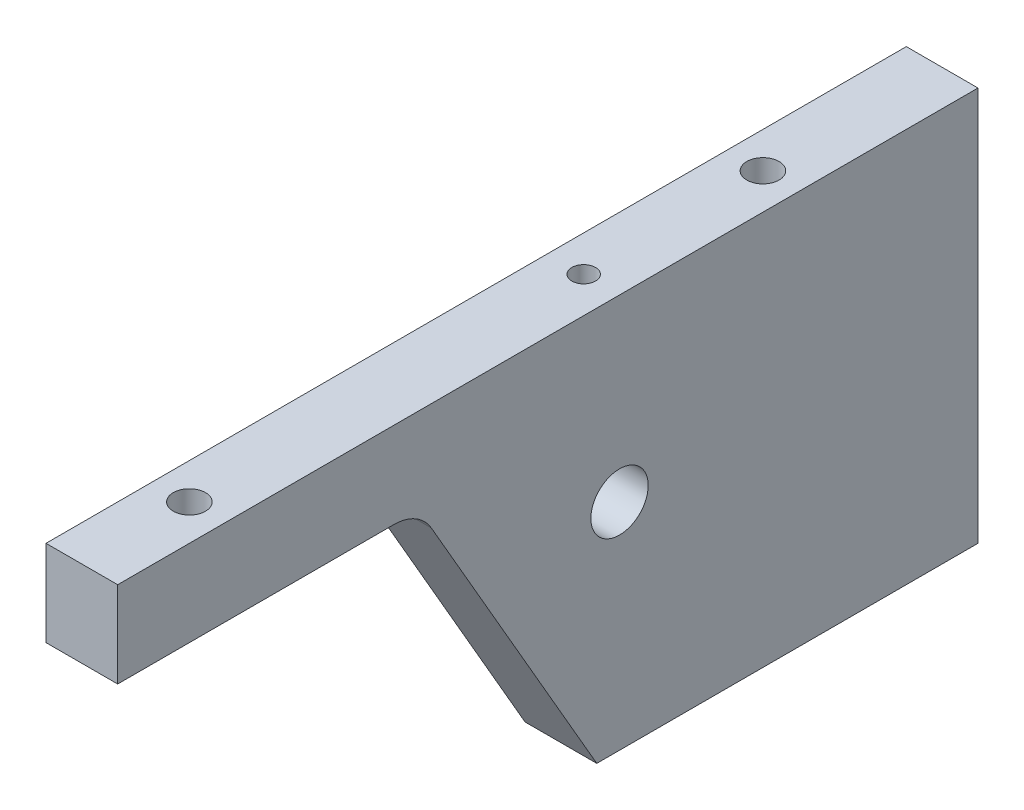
ISO-10303-21;
HEADER;
FILE_DESCRIPTION(('STEP AP214'),'2;1');
FILE_NAME('part.step','',(''),(''),'','','');
FILE_SCHEMA(('AUTOMOTIVE_DESIGN { 1 0 10303 214 1 1 1 1 }'));
ENDSEC;
DATA;
#1=APPLICATION_CONTEXT('core data for automotive mechanical design processes');
#2=APPLICATION_PROTOCOL_DEFINITION('international standard','automotive_design',2000,#1);
#3=PRODUCT_CONTEXT('',#1,'mechanical');
#4=PRODUCT('Part','Part','',(#3));
#5=PRODUCT_RELATED_PRODUCT_CATEGORY('part','',(#4));
#6=PRODUCT_DEFINITION_FORMATION('','',#4);
#7=PRODUCT_DEFINITION_CONTEXT('part definition',#1,'design');
#8=PRODUCT_DEFINITION('design','',#6,#7);
#9=PRODUCT_DEFINITION_SHAPE('','',#8);
#10=(LENGTH_UNIT() NAMED_UNIT(*) SI_UNIT(.MILLI.,.METRE.));
#11=(NAMED_UNIT(*) PLANE_ANGLE_UNIT() SI_UNIT($,.RADIAN.));
#12=(NAMED_UNIT(*) SI_UNIT($,.STERADIAN.) SOLID_ANGLE_UNIT());
#13=UNCERTAINTY_MEASURE_WITH_UNIT(LENGTH_MEASURE(1.E-05),#10,'distance_accuracy_value','');
#14=(GEOMETRIC_REPRESENTATION_CONTEXT(3) GLOBAL_UNCERTAINTY_ASSIGNED_CONTEXT((#13)) GLOBAL_UNIT_ASSIGNED_CONTEXT((#10,
#11,#12)) REPRESENTATION_CONTEXT('',''));
#15=CARTESIAN_POINT('',(0.,0.,0.));
#16=DIRECTION('',(0.,0.,1.));
#17=DIRECTION('',(1.,0.,0.));
#18=AXIS2_PLACEMENT_3D('',#15,#16,#17);
#19=CARTESIAN_POINT('',(5.,0.,120.));
#20=DIRECTION('',(0.,-1.,0.));
#21=DIRECTION('',(0.,0.,-1.));
#22=AXIS2_PLACEMENT_3D('',#19,#20,#21);
#23=PLANE('',#22);
#24=CARTESIAN_POINT('',(0.,0.,105.));
#25=DIRECTION('',(0.,-1.,0.));
#26=DIRECTION('',(0.,0.,-1.));
#27=AXIS2_PLACEMENT_3D('',#24,#25,#26);
#28=CIRCLE('',#27,2.25);
#29=CARTESIAN_POINT('',(0.,0.,102.75));
#30=VERTEX_POINT('',#29);
#31=EDGE_CURVE('E285',#30,#30,#28,.T.);
#32=ORIENTED_EDGE('',*,*,#31,.T.);
#33=EDGE_LOOP('',(#32));
#34=FACE_BOUND('',#33,.T.);
#35=CARTESIAN_POINT('',(0.,0.,25.));
#36=DIRECTION('',(0.,-1.,0.));
#37=DIRECTION('',(0.,0.,-1.));
#38=AXIS2_PLACEMENT_3D('',#35,#36,#37);
#39=CIRCLE('',#38,2.24999999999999);
#40=CARTESIAN_POINT('',(0.,0.,22.75));
#41=VERTEX_POINT('',#40);
#42=EDGE_CURVE('E273',#41,#41,#39,.T.);
#43=ORIENTED_EDGE('',*,*,#42,.T.);
#44=EDGE_LOOP('',(#43));
#45=FACE_BOUND('',#44,.T.);
#46=CARTESIAN_POINT('',(0.,0.,50.));
#47=DIRECTION('',(0.,1.,0.));
#48=DIRECTION('',(0.,0.,1.));
#49=AXIS2_PLACEMENT_3D('',#46,#47,#48);
#50=CIRCLE('',#49,1.65);
#51=CARTESIAN_POINT('',(0.,0.,51.65));
#52=VERTEX_POINT('',#51);
#53=EDGE_CURVE('E264',#52,#52,#50,.T.);
#54=ORIENTED_EDGE('',*,*,#53,.F.);
#55=EDGE_LOOP('',(#54));
#56=FACE_BOUND('',#55,.T.);
#57=DIRECTION('',(0.,0.,1.));
#58=VECTOR('',#57,1.);
#59=CARTESIAN_POINT('',(-5.,0.,120.));
#60=LINE('',#59,#58);
#61=CARTESIAN_POINT('',(-5.,0.,0.));
#62=VERTEX_POINT('',#61);
#63=CARTESIAN_POINT('',(-5.,0.,120.));
#64=VERTEX_POINT('',#63);
#65=EDGE_CURVE('E131',#62,#64,#60,.T.);
#66=ORIENTED_EDGE('',*,*,#65,.T.);
#67=DIRECTION('',(-1.,0.,0.));
#68=VECTOR('',#67,1.);
#69=CARTESIAN_POINT('',(5.,0.,120.));
#70=LINE('',#69,#68);
#71=CARTESIAN_POINT('',(5.,0.,120.));
#72=VERTEX_POINT('',#71);
#73=EDGE_CURVE('E169',#72,#64,#70,.T.);
#74=ORIENTED_EDGE('',*,*,#73,.F.);
#75=DIRECTION('',(0.,0.,1.));
#76=VECTOR('',#75,1.);
#77=CARTESIAN_POINT('',(5.,0.,120.));
#78=LINE('',#77,#76);
#79=CARTESIAN_POINT('',(5.,0.,0.));
#80=VERTEX_POINT('',#79);
#81=EDGE_CURVE('E132',#80,#72,#78,.T.);
#82=ORIENTED_EDGE('',*,*,#81,.F.);
#83=DIRECTION('',(-1.,0.,0.));
#84=VECTOR('',#83,1.);
#85=CARTESIAN_POINT('',(5.,0.,0.));
#86=LINE('',#85,#84);
#87=EDGE_CURVE('E146',#80,#62,#86,.T.);
#88=ORIENTED_EDGE('',*,*,#87,.T.);
#89=EDGE_LOOP('',(#66,#74,#82,#88));
#90=FACE_BOUND('',#89,.T.);
#91=ADVANCED_FACE('F36',(#34,#45,#56,#90),#23,.F.);
#92=CARTESIAN_POINT('',(5.,0.,120.));
#93=DIRECTION('',(0.,0.,-1.));
#94=DIRECTION('',(-1.,0.,0.));
#95=AXIS2_PLACEMENT_3D('',#92,#93,#94);
#96=PLANE('',#95);
#97=DIRECTION('',(0.,-1.,0.));
#98=VECTOR('',#97,1.);
#99=CARTESIAN_POINT('',(-5.,0.,120.));
#100=LINE('',#99,#98);
#101=CARTESIAN_POINT('',(-5.,-12.,120.));
#102=VERTEX_POINT('',#101);
#103=EDGE_CURVE('E149',#64,#102,#100,.T.);
#104=ORIENTED_EDGE('',*,*,#103,.T.);
#105=DIRECTION('',(-1.,0.,0.));
#106=VECTOR('',#105,1.);
#107=CARTESIAN_POINT('',(5.,-12.,120.));
#108=LINE('',#107,#106);
#109=CARTESIAN_POINT('',(5.,-12.,120.));
#110=VERTEX_POINT('',#109);
#111=EDGE_CURVE('E166',#110,#102,#108,.T.);
#112=ORIENTED_EDGE('',*,*,#111,.F.);
#113=DIRECTION('',(0.,-1.,0.));
#114=VECTOR('',#113,1.);
#115=CARTESIAN_POINT('',(5.,0.,120.));
#116=LINE('',#115,#114);
#117=EDGE_CURVE('E135',#72,#110,#116,.T.);
#118=ORIENTED_EDGE('',*,*,#117,.F.);
#119=ORIENTED_EDGE('',*,*,#73,.T.);
#120=EDGE_LOOP('',(#104,#112,#118,#119));
#121=FACE_BOUND('',#120,.T.);
#122=ADVANCED_FACE('F209',(#121),#96,.F.);
#123=CARTESIAN_POINT('',(5.,-12.,120.));
#124=DIRECTION('',(0.,1.,0.));
#125=DIRECTION('',(0.,0.,1.));
#126=AXIS2_PLACEMENT_3D('',#123,#124,#125);
#127=PLANE('',#126);
#128=CARTESIAN_POINT('',(0.,-12.,105.));
#129=DIRECTION('',(0.,-1.,0.));
#130=DIRECTION('',(0.,0.,-1.));
#131=AXIS2_PLACEMENT_3D('',#128,#129,#130);
#132=CIRCLE('',#131,4.);
#133=CARTESIAN_POINT('',(0.,-12.,101.));
#134=VERTEX_POINT('',#133);
#135=EDGE_CURVE('E293',#134,#134,#132,.T.);
#136=ORIENTED_EDGE('',*,*,#135,.F.);
#137=EDGE_LOOP('',(#136));
#138=FACE_BOUND('',#137,.T.);
#139=DIRECTION('',(0.,0.,-1.));
#140=VECTOR('',#139,1.);
#141=CARTESIAN_POINT('',(-5.,-12.,120.));
#142=LINE('',#141,#140);
#143=CARTESIAN_POINT('',(-5.,-12.,81.4641016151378));
#144=VERTEX_POINT('',#143);
#145=EDGE_CURVE('E151',#102,#144,#142,.T.);
#146=ORIENTED_EDGE('',*,*,#145,.T.);
#147=DIRECTION('',(-1.,0.,0.));
#148=VECTOR('',#147,1.);
#149=CARTESIAN_POINT('',(5.,-12.,81.4641016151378));
#150=LINE('',#149,#148);
#151=CARTESIAN_POINT('',(5.,-12.,81.4641016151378));
#152=VERTEX_POINT('',#151);
#153=EDGE_CURVE('E51',#144,#152,#150,.F.);
#154=ORIENTED_EDGE('',*,*,#153,.T.);
#155=DIRECTION('',(0.,0.,-1.));
#156=VECTOR('',#155,1.);
#157=CARTESIAN_POINT('',(5.,-12.,120.));
#158=LINE('',#157,#156);
#159=EDGE_CURVE('E138',#110,#152,#158,.T.);
#160=ORIENTED_EDGE('',*,*,#159,.F.);
#161=ORIENTED_EDGE('',*,*,#111,.T.);
#162=EDGE_LOOP('',(#146,#154,#160,#161));
#163=FACE_BOUND('',#162,.T.);
#164=ADVANCED_FACE('F214',(#138,#163),#127,.F.);
#165=CARTESIAN_POINT('',(5.,-12.,78.));
#166=DIRECTION('',(0.,0.499999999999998,-0.86602540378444));
#167=DIRECTION('',(0.,0.86602540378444,0.499999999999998));
#168=AXIS2_PLACEMENT_3D('',#165,#166,#167);
#169=PLANE('',#168);
#170=DIRECTION('',(0.,-0.86602540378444,-0.499999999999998));
#171=VECTOR('',#170,1.);
#172=CARTESIAN_POINT('',(5.,-12.,78.));
#173=LINE('',#172,#171);
#174=CARTESIAN_POINT('',(5.,-15.,76.2679491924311));
#175=VERTEX_POINT('',#174);
#176=CARTESIAN_POINT('',(5.,-55.,53.1739384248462));
#177=VERTEX_POINT('',#176);
#178=EDGE_CURVE('E140',#175,#177,#173,.T.);
#179=ORIENTED_EDGE('',*,*,#178,.F.);
#180=DIRECTION('',(-1.,0.,0.));
#181=VECTOR('',#180,1.);
#182=CARTESIAN_POINT('',(-5.,-15.,76.2679491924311));
#183=LINE('',#182,#181);
#184=CARTESIAN_POINT('',(-5.,-15.,76.2679491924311));
#185=VERTEX_POINT('',#184);
#186=EDGE_CURVE('E172',#175,#185,#183,.T.);
#187=ORIENTED_EDGE('',*,*,#186,.T.);
#188=DIRECTION('',(0.,-0.86602540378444,-0.499999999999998));
#189=VECTOR('',#188,1.);
#190=CARTESIAN_POINT('',(-5.,-12.,78.));
#191=LINE('',#190,#189);
#192=CARTESIAN_POINT('',(-5.,-55.,53.1739384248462));
#193=VERTEX_POINT('',#192);
#194=EDGE_CURVE('E153',#185,#193,#191,.T.);
#195=ORIENTED_EDGE('',*,*,#194,.T.);
#196=DIRECTION('',(-1.,0.,0.));
#197=VECTOR('',#196,1.);
#198=CARTESIAN_POINT('',(5.,-55.,53.1739384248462));
#199=LINE('',#198,#197);
#200=EDGE_CURVE('E163',#177,#193,#199,.T.);
#201=ORIENTED_EDGE('',*,*,#200,.F.);
#202=EDGE_LOOP('',(#179,#187,#195,#201));
#203=FACE_BOUND('',#202,.T.);
#204=ADVANCED_FACE('F178',(#203),#169,.F.);
#205=CARTESIAN_POINT('',(5.,-55.,0.));
#206=DIRECTION('',(0.,1.,0.));
#207=DIRECTION('',(0.,0.,1.));
#208=AXIS2_PLACEMENT_3D('',#205,#206,#207);
#209=PLANE('',#208);
#210=CARTESIAN_POINT('',(0.,-55.,25.));
#211=DIRECTION('',(0.,-1.,0.));
#212=DIRECTION('',(0.,0.,-1.));
#213=AXIS2_PLACEMENT_3D('',#210,#211,#212);
#214=CIRCLE('',#213,4.);
#215=CARTESIAN_POINT('',(0.,-55.,21.));
#216=VERTEX_POINT('',#215);
#217=EDGE_CURVE('E282',#216,#216,#214,.T.);
#218=ORIENTED_EDGE('',*,*,#217,.F.);
#219=EDGE_LOOP('',(#218));
#220=FACE_BOUND('',#219,.T.);
#221=DIRECTION('',(0.,0.,-1.));
#222=VECTOR('',#221,1.);
#223=CARTESIAN_POINT('',(-5.,-55.,0.));
#224=LINE('',#223,#222);
#225=CARTESIAN_POINT('',(-5.,-55.,0.));
#226=VERTEX_POINT('',#225);
#227=EDGE_CURVE('E155',#193,#226,#224,.T.);
#228=ORIENTED_EDGE('',*,*,#227,.T.);
#229=DIRECTION('',(-1.,0.,0.));
#230=VECTOR('',#229,1.);
#231=CARTESIAN_POINT('',(5.,-55.,0.));
#232=LINE('',#231,#230);
#233=CARTESIAN_POINT('',(5.,-55.,0.));
#234=VERTEX_POINT('',#233);
#235=EDGE_CURVE('E160',#234,#226,#232,.T.);
#236=ORIENTED_EDGE('',*,*,#235,.F.);
#237=DIRECTION('',(0.,0.,-1.));
#238=VECTOR('',#237,1.);
#239=CARTESIAN_POINT('',(5.,-55.,0.));
#240=LINE('',#239,#238);
#241=EDGE_CURVE('E142',#177,#234,#240,.T.);
#242=ORIENTED_EDGE('',*,*,#241,.F.);
#243=ORIENTED_EDGE('',*,*,#200,.T.);
#244=EDGE_LOOP('',(#228,#236,#242,#243));
#245=FACE_BOUND('',#244,.T.);
#246=ADVANCED_FACE('F188',(#220,#245),#209,.F.);
#247=CARTESIAN_POINT('',(5.,0.,0.));
#248=DIRECTION('',(0.,0.,1.));
#249=DIRECTION('',(0.,-1.,0.));
#250=AXIS2_PLACEMENT_3D('',#247,#248,#249);
#251=PLANE('',#250);
#252=CARTESIAN_POINT('',(0.,-10.,0.));
#253=DIRECTION('',(0.,0.,-1.));
#254=DIRECTION('',(0.,1.,0.));
#255=AXIS2_PLACEMENT_3D('',#252,#253,#254);
#256=CIRCLE('',#255,1.65);
#257=CARTESIAN_POINT('',(0.,-8.35,0.));
#258=VERTEX_POINT('',#257);
#259=EDGE_CURVE('E113',#258,#258,#256,.T.);
#260=ORIENTED_EDGE('',*,*,#259,.F.);
#261=EDGE_LOOP('',(#260));
#262=FACE_BOUND('',#261,.T.);
#263=CARTESIAN_POINT('',(0.,-27.5,0.));
#264=DIRECTION('',(0.,0.,-1.));
#265=DIRECTION('',(0.,1.,0.));
#266=AXIS2_PLACEMENT_3D('',#263,#264,#265);
#267=CIRCLE('',#266,1.65);
#268=CARTESIAN_POINT('',(0.,-25.85,0.));
#269=VERTEX_POINT('',#268);
#270=EDGE_CURVE('E112',#269,#269,#267,.T.);
#271=ORIENTED_EDGE('',*,*,#270,.F.);
#272=EDGE_LOOP('',(#271));
#273=FACE_BOUND('',#272,.T.);
#274=CARTESIAN_POINT('',(0.,-45.,0.));
#275=DIRECTION('',(0.,0.,-1.));
#276=DIRECTION('',(0.,1.,0.));
#277=AXIS2_PLACEMENT_3D('',#274,#275,#276);
#278=CIRCLE('',#277,1.65);
#279=CARTESIAN_POINT('',(0.,-43.35,0.));
#280=VERTEX_POINT('',#279);
#281=EDGE_CURVE('E125',#280,#280,#278,.T.);
#282=ORIENTED_EDGE('',*,*,#281,.F.);
#283=EDGE_LOOP('',(#282));
#284=FACE_BOUND('',#283,.T.);
#285=DIRECTION('',(0.,1.,0.));
#286=VECTOR('',#285,1.);
#287=CARTESIAN_POINT('',(-5.,0.,0.));
#288=LINE('',#287,#286);
#289=EDGE_CURVE('E136',#226,#62,#288,.T.);
#290=ORIENTED_EDGE('',*,*,#289,.T.);
#291=ORIENTED_EDGE('',*,*,#87,.F.);
#292=DIRECTION('',(0.,1.,0.));
#293=VECTOR('',#292,1.);
#294=CARTESIAN_POINT('',(5.,0.,0.));
#295=LINE('',#294,#293);
#296=EDGE_CURVE('E144',#234,#80,#295,.T.);
#297=ORIENTED_EDGE('',*,*,#296,.F.);
#298=ORIENTED_EDGE('',*,*,#235,.T.);
#299=EDGE_LOOP('',(#290,#291,#297,#298));
#300=FACE_BOUND('',#299,.T.);
#301=ADVANCED_FACE('F192',(#262,#273,#284,#300),#251,.F.);
#302=CARTESIAN_POINT('',(5.,0.,0.));
#303=DIRECTION('',(-1.,0.,0.));
#304=DIRECTION('',(0.,0.,1.));
#305=AXIS2_PLACEMENT_3D('',#302,#303,#304);
#306=PLANE('',#305);
#307=CARTESIAN_POINT('',(5.,-25.,50.));
#308=DIRECTION('',(1.,0.,0.));
#309=DIRECTION('',(0.,0.,-1.));
#310=AXIS2_PLACEMENT_3D('',#307,#308,#309);
#311=CIRCLE('',#310,4.00000000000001);
#312=CARTESIAN_POINT('',(5.,-25.,46.));
#313=VERTEX_POINT('',#312);
#314=EDGE_CURVE('E263',#313,#313,#311,.T.);
#315=ORIENTED_EDGE('',*,*,#314,.F.);
#316=EDGE_LOOP('',(#315));
#317=FACE_BOUND('',#316,.T.);
#318=ORIENTED_EDGE('',*,*,#81,.T.);
#319=ORIENTED_EDGE('',*,*,#117,.T.);
#320=ORIENTED_EDGE('',*,*,#159,.T.);
#321=CARTESIAN_POINT('',(5.,-18.,81.4641016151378));
#322=DIRECTION('',(-1.,0.,0.));
#323=DIRECTION('',(0.,0.,1.));
#324=AXIS2_PLACEMENT_3D('',#321,#322,#323);
#325=CIRCLE('',#324,6.);
#326=EDGE_CURVE('E11',#152,#175,#325,.T.);
#327=ORIENTED_EDGE('',*,*,#326,.T.);
#328=ORIENTED_EDGE('',*,*,#178,.T.);
#329=ORIENTED_EDGE('',*,*,#241,.T.);
#330=ORIENTED_EDGE('',*,*,#296,.T.);
#331=EDGE_LOOP('',(#318,#319,#320,#327,#328,#329,#330));
#332=FACE_BOUND('',#331,.T.);
#333=ADVANCED_FACE('F196',(#317,#332),#306,.F.);
#334=CARTESIAN_POINT('',(-5.,0.,0.));
#335=DIRECTION('',(-1.,0.,0.));
#336=DIRECTION('',(0.,0.,1.));
#337=AXIS2_PLACEMENT_3D('',#334,#335,#336);
#338=PLANE('',#337);
#339=CARTESIAN_POINT('',(-5.,-25.,50.));
#340=DIRECTION('',(-1.,0.,0.));
#341=DIRECTION('',(0.,0.,1.));
#342=AXIS2_PLACEMENT_3D('',#339,#340,#341);
#343=CIRCLE('',#342,4.00000000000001);
#344=CARTESIAN_POINT('',(-5.,-25.,54.));
#345=VERTEX_POINT('',#344);
#346=EDGE_CURVE('E119',#345,#345,#343,.F.);
#347=ORIENTED_EDGE('',*,*,#346,.T.);
#348=EDGE_LOOP('',(#347));
#349=FACE_BOUND('',#348,.T.);
#350=ORIENTED_EDGE('',*,*,#65,.F.);
#351=ORIENTED_EDGE('',*,*,#289,.F.);
#352=ORIENTED_EDGE('',*,*,#227,.F.);
#353=ORIENTED_EDGE('',*,*,#194,.F.);
#354=CARTESIAN_POINT('',(-5.,-18.,81.4641016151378));
#355=DIRECTION('',(-1.,0.,0.));
#356=DIRECTION('',(0.,0.,1.));
#357=AXIS2_PLACEMENT_3D('',#354,#355,#356);
#358=CIRCLE('',#357,6.);
#359=EDGE_CURVE('E44',#185,#144,#358,.F.);
#360=ORIENTED_EDGE('',*,*,#359,.T.);
#361=ORIENTED_EDGE('',*,*,#145,.F.);
#362=ORIENTED_EDGE('',*,*,#103,.F.);
#363=EDGE_LOOP('',(#350,#351,#352,#353,#360,#361,#362));
#364=FACE_BOUND('',#363,.T.);
#365=ADVANCED_FACE('F184',(#349,#364),#338,.T.);
#366=CARTESIAN_POINT('',(0.,-45.,10.1));
#367=DIRECTION('',(0.,0.,-1.));
#368=DIRECTION('',(0.,1.,0.));
#369=AXIS2_PLACEMENT_3D('',#366,#367,#368);
#370=CONICAL_SURFACE('',#369,1.65,1.02974425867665);
#371=CARTESIAN_POINT('',(0.,-45.,11.0914200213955));
#372=VERTEX_POINT('',#371);
#373=VERTEX_LOOP('',#372);
#374=FACE_BOUND('',#373,.T.);
#375=CARTESIAN_POINT('',(0.,-45.,10.1));
#376=DIRECTION('',(0.,0.,-1.));
#377=DIRECTION('',(0.,1.,0.));
#378=AXIS2_PLACEMENT_3D('',#375,#376,#377);
#379=CIRCLE('',#378,1.65);
#380=CARTESIAN_POINT('',(0.,-43.35,10.1));
#381=VERTEX_POINT('',#380);
#382=EDGE_CURVE('E128',#381,#381,#379,.T.);
#383=ORIENTED_EDGE('',*,*,#382,.T.);
#384=EDGE_LOOP('',(#383));
#385=FACE_BOUND('',#384,.T.);
#386=ADVANCED_FACE('F233',(#374,#385),#370,.F.);
#387=CARTESIAN_POINT('',(0.,-45.,0.));
#388=DIRECTION('',(0.,0.,-1.));
#389=DIRECTION('',(0.,1.,0.));
#390=AXIS2_PLACEMENT_3D('',#387,#388,#389);
#391=CYLINDRICAL_SURFACE('',#390,1.65);
#392=ORIENTED_EDGE('',*,*,#382,.F.);
#393=EDGE_LOOP('',(#392));
#394=FACE_BOUND('',#393,.T.);
#395=ORIENTED_EDGE('',*,*,#281,.T.);
#396=EDGE_LOOP('',(#395));
#397=FACE_BOUND('',#396,.T.);
#398=ADVANCED_FACE('F240',(#394,#397),#391,.F.);
#399=CARTESIAN_POINT('',(0.,-27.5,10.1));
#400=DIRECTION('',(0.,0.,-1.));
#401=DIRECTION('',(0.,1.,0.));
#402=AXIS2_PLACEMENT_3D('',#399,#400,#401);
#403=CONICAL_SURFACE('',#402,1.65,1.02974425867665);
#404=CARTESIAN_POINT('',(0.,-27.5,11.0914200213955));
#405=VERTEX_POINT('',#404);
#406=VERTEX_LOOP('',#405);
#407=FACE_BOUND('',#406,.T.);
#408=CARTESIAN_POINT('',(0.,-27.5,10.1));
#409=DIRECTION('',(0.,0.,-1.));
#410=DIRECTION('',(0.,1.,0.));
#411=AXIS2_PLACEMENT_3D('',#408,#409,#410);
#412=CIRCLE('',#411,1.65);
#413=CARTESIAN_POINT('',(0.,-25.85,10.1));
#414=VERTEX_POINT('',#413);
#415=EDGE_CURVE('E116',#414,#414,#412,.T.);
#416=ORIENTED_EDGE('',*,*,#415,.T.);
#417=EDGE_LOOP('',(#416));
#418=FACE_BOUND('',#417,.T.);
#419=ADVANCED_FACE('F244',(#407,#418),#403,.F.);
#420=CARTESIAN_POINT('',(0.,-27.5,0.));
#421=DIRECTION('',(0.,0.,-1.));
#422=DIRECTION('',(0.,1.,0.));
#423=AXIS2_PLACEMENT_3D('',#420,#421,#422);
#424=CYLINDRICAL_SURFACE('',#423,1.65);
#425=ORIENTED_EDGE('',*,*,#415,.F.);
#426=EDGE_LOOP('',(#425));
#427=FACE_BOUND('',#426,.T.);
#428=ORIENTED_EDGE('',*,*,#270,.T.);
#429=EDGE_LOOP('',(#428));
#430=FACE_BOUND('',#429,.T.);
#431=ADVANCED_FACE('F106',(#427,#430),#424,.F.);
#432=CARTESIAN_POINT('',(0.,-10.,10.1));
#433=DIRECTION('',(0.,0.,-1.));
#434=DIRECTION('',(0.,1.,0.));
#435=AXIS2_PLACEMENT_3D('',#432,#433,#434);
#436=CONICAL_SURFACE('',#435,1.65,1.02974425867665);
#437=CARTESIAN_POINT('',(0.,-10.,11.0914200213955));
#438=VERTEX_POINT('',#437);
#439=VERTEX_LOOP('',#438);
#440=FACE_BOUND('',#439,.T.);
#441=CARTESIAN_POINT('',(0.,-10.,10.1));
#442=DIRECTION('',(0.,0.,-1.));
#443=DIRECTION('',(0.,1.,0.));
#444=AXIS2_PLACEMENT_3D('',#441,#442,#443);
#445=CIRCLE('',#444,1.65);
#446=CARTESIAN_POINT('',(0.,-8.35000000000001,10.1));
#447=VERTEX_POINT('',#446);
#448=EDGE_CURVE('E110',#447,#447,#445,.T.);
#449=ORIENTED_EDGE('',*,*,#448,.T.);
#450=EDGE_LOOP('',(#449));
#451=FACE_BOUND('',#450,.T.);
#452=ADVANCED_FACE('F102',(#440,#451),#436,.F.);
#453=CARTESIAN_POINT('',(0.,-10.,0.));
#454=DIRECTION('',(0.,0.,-1.));
#455=DIRECTION('',(0.,1.,0.));
#456=AXIS2_PLACEMENT_3D('',#453,#454,#455);
#457=CYLINDRICAL_SURFACE('',#456,1.65);
#458=ORIENTED_EDGE('',*,*,#448,.F.);
#459=EDGE_LOOP('',(#458));
#460=FACE_BOUND('',#459,.T.);
#461=ORIENTED_EDGE('',*,*,#259,.T.);
#462=EDGE_LOOP('',(#461));
#463=FACE_BOUND('',#462,.T.);
#464=ADVANCED_FACE('F105',(#460,#463),#457,.F.);
#465=CARTESIAN_POINT('',(5.,-18.,81.4641016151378));
#466=DIRECTION('',(1.,0.,0.));
#467=DIRECTION('',(0.,0.,-1.));
#468=AXIS2_PLACEMENT_3D('',#465,#466,#467);
#469=CYLINDRICAL_SURFACE('',#468,6.);
#470=ORIENTED_EDGE('',*,*,#326,.F.);
#471=ORIENTED_EDGE('',*,*,#153,.F.);
#472=ORIENTED_EDGE('',*,*,#359,.F.);
#473=ORIENTED_EDGE('',*,*,#186,.F.);
#474=EDGE_LOOP('',(#470,#471,#472,#473));
#475=FACE_BOUND('',#474,.T.);
#476=ADVANCED_FACE('F38',(#475),#469,.F.);
#477=CARTESIAN_POINT('',(-16.3137084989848,-25.,50.));
#478=DIRECTION('',(1.,0.,0.));
#479=DIRECTION('',(0.,0.,-1.));
#480=AXIS2_PLACEMENT_3D('',#477,#478,#479);
#481=CYLINDRICAL_SURFACE('',#480,4.00000000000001);
#482=CARTESIAN_POINT('',(0.,-21.3561695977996,51.65));
#483=CARTESIAN_POINT('',(0.0880964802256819,-21.3561605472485,51.649990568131));
#484=CARTESIAN_POINT('',(0.176340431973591,-21.3529282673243,51.6428998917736));
#485=CARTESIAN_POINT('',(0.350287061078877,-21.3404079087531,51.6148084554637));
#486=CARTESIAN_POINT('',(0.435982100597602,-21.3311032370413,51.5937695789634));
#487=CARTESIAN_POINT('',(0.602002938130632,-21.3076867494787,51.5387353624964));
#488=CARTESIAN_POINT('',(0.682348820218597,-21.2935942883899,51.5047921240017));
#489=CARTESIAN_POINT('',(0.836181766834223,-21.2622176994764,51.4250653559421));
#490=CARTESIAN_POINT('',(0.909670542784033,-21.2449343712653,51.3792847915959));
#491=CARTESIAN_POINT('',(1.0522286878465,-21.2079446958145,51.2741985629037));
#492=CARTESIAN_POINT('',(1.12082925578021,-21.1881572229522,51.2142851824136));
#493=CARTESIAN_POINT('',(1.24735477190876,-21.1490563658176,51.0839107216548));
#494=CARTESIAN_POINT('',(1.30527565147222,-21.129743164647,51.0134456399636));
#495=CARTESIAN_POINT('',(1.41117137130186,-21.0927842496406,50.8603019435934));
#496=CARTESIAN_POINT('',(1.45862093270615,-21.0752438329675,50.7772323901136));
#497=CARTESIAN_POINT('',(1.5386701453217,-21.044797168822,50.6034363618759));
#498=CARTESIAN_POINT('',(1.57127626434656,-21.0318889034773,50.512713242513));
#499=CARTESIAN_POINT('',(1.61902070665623,-21.0127359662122,50.3311051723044));
#500=CARTESIAN_POINT('',(1.63496684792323,-21.0061843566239,50.2404656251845));
#501=CARTESIAN_POINT('',(1.65154665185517,-20.9993693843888,50.0575763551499));
#502=CARTESIAN_POINT('',(1.65218639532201,-20.9991035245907,49.965327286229));
#503=CARTESIAN_POINT('',(1.6385635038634,-21.0047077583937,49.787702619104));
#504=CARTESIAN_POINT('',(1.6251878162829,-21.0102126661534,49.7022453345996));
#505=CARTESIAN_POINT('',(1.58543118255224,-21.0262407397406,49.5349141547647));
#506=CARTESIAN_POINT('',(1.55904927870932,-21.036764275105,49.4530405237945));
#507=CARTESIAN_POINT('',(1.49371233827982,-21.062010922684,49.2937043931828));
#508=CARTESIAN_POINT('',(1.45457201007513,-21.0767955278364,49.2163280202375));
#509=CARTESIAN_POINT('',(1.3650087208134,-21.1091123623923,49.0690395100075));
#510=CARTESIAN_POINT('',(1.3145817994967,-21.1266455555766,48.9991300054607));
#511=CARTESIAN_POINT('',(1.19981176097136,-21.1641286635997,48.8636146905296));
#512=CARTESIAN_POINT('',(1.13474658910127,-21.1841618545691,48.7986425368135));
#513=CARTESIAN_POINT('',(0.994590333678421,-21.2234685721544,48.6802616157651));
#514=CARTESIAN_POINT('',(0.919495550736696,-21.2427418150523,48.626857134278));
#515=CARTESIAN_POINT('',(0.758401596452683,-21.2789339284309,48.5315466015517));
#516=CARTESIAN_POINT('',(0.672132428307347,-21.2957589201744,48.4900582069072));
#517=CARTESIAN_POINT('',(0.492953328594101,-21.3240361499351,48.422454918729));
#518=CARTESIAN_POINT('',(0.400048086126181,-21.3354921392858,48.3963292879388));
#519=CARTESIAN_POINT('',(0.216577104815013,-21.3508090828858,48.3617867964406));
#520=CARTESIAN_POINT('',(0.126241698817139,-21.3551088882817,48.3523443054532));
#521=CARTESIAN_POINT('',(-0.0548056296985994,-21.3568801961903,48.3484289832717));
#522=CARTESIAN_POINT('',(-0.145517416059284,-21.3543539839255,48.353951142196));
#523=CARTESIAN_POINT('',(-0.318801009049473,-21.3432105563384,48.3788728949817));
#524=CARTESIAN_POINT('',(-0.401528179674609,-21.3349819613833,48.3973879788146));
#525=CARTESIAN_POINT('',(-0.562637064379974,-21.3138538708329,48.4466041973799));
#526=CARTESIAN_POINT('',(-0.64101777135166,-21.3009532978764,48.4773081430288));
#527=CARTESIAN_POINT('',(-0.794879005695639,-21.2712752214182,48.5514609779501));
#528=CARTESIAN_POINT('',(-0.870100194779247,-21.2543578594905,48.5953902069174));
#529=CARTESIAN_POINT('',(-1.01246016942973,-21.2187547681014,48.6942654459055));
#530=CARTESIAN_POINT('',(-1.07959548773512,-21.2000682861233,48.7492161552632));
#531=CARTESIAN_POINT('',(-1.20942962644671,-21.1612398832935,48.873724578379));
#532=CARTESIAN_POINT('',(-1.27135173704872,-21.1411003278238,48.944096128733));
#533=CARTESIAN_POINT('',(-1.38264285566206,-21.1030188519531,49.0947020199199));
#534=CARTESIAN_POINT('',(-1.43201105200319,-21.0850770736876,49.1749369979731));
#535=CARTESIAN_POINT('',(-1.51670413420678,-21.0533123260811,49.3434831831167));
#536=CARTESIAN_POINT('',(-1.55200347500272,-21.0394968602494,49.4318087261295));
#537=CARTESIAN_POINT('',(-1.60699165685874,-21.0176289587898,49.6138591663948));
#538=CARTESIAN_POINT('',(-1.62668958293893,-21.0095731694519,49.7075808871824));
#539=CARTESIAN_POINT('',(-1.64878822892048,-21.0005110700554,49.8908128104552));
#540=CARTESIAN_POINT('',(-1.65228482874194,-20.9990582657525,49.9801696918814));
#541=CARTESIAN_POINT('',(-1.64481456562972,-21.0021377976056,50.1581617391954));
#542=CARTESIAN_POINT('',(-1.63385015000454,-21.0066691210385,50.2467970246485));
#543=CARTESIAN_POINT('',(-1.59855535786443,-21.020975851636,50.4177053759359));
#544=CARTESIAN_POINT('',(-1.57469555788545,-21.0305663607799,50.5000923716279));
#545=CARTESIAN_POINT('',(-1.51479588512,-21.0539451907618,50.6596673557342));
#546=CARTESIAN_POINT('',(-1.47875367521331,-21.0677343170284,50.7368543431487));
#547=CARTESIAN_POINT('',(-1.39369547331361,-21.0989419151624,50.8876611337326));
#548=CARTESIAN_POINT('',(-1.34416874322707,-21.1164957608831,50.9609642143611));
#549=CARTESIAN_POINT('',(-1.23429715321,-21.1531429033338,51.098529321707));
#550=CARTESIAN_POINT('',(-1.17394837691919,-21.1722367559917,51.1627880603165));
#551=CARTESIAN_POINT('',(-1.03941247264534,-21.2114025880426,51.2848776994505));
#552=CARTESIAN_POINT('',(-0.964572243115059,-21.2314552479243,51.3419976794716));
#553=CARTESIAN_POINT('',(-0.805734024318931,-21.2689458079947,51.4429647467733));
#554=CARTESIAN_POINT('',(-0.721731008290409,-21.2863822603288,51.486804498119));
#555=CARTESIAN_POINT('',(-0.547271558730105,-21.3162961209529,51.5594444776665));
#556=CARTESIAN_POINT('',(-0.456860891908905,-21.3288051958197,51.5883411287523));
#557=CARTESIAN_POINT('',(-0.271952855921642,-21.3471816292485,51.6301726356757));
#558=CARTESIAN_POINT('',(-0.177470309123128,-21.3530712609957,51.6431610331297));
#559=CARTESIAN_POINT('',(-0.0551366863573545,-21.3558594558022,51.6493120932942));
#560=CARTESIAN_POINT('',(-0.0275755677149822,-21.3561724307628,51.6500029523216));
#561=CARTESIAN_POINT('',(0.,-21.3561695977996,51.65));
#562=B_SPLINE_CURVE_WITH_KNOTS('',3,(#482,#483,#484,#485,#486,#487,#488,#489,#490,#491,#492,
#493,#494,#495,#496,#497,#498,#499,#500,#501,#502,#503,#504,#505,#506,#507,#508,#509,#510,#511,
#512,#513,#514,#515,#516,#517,#518,#519,#520,#521,#522,#523,#524,#525,#526,#527,#528,#529,#530,
#531,#532,#533,#534,#535,#536,#537,#538,#539,#540,#541,#542,#543,#544,#545,#546,#547,#548,#549,
#550,#551,#552,#553,#554,#555,#556,#557,#558,#559,#560,#561),.UNSPECIFIED.,.T.,.F.,(4,2,2,2,2,2,
2,2,2,2,2,2,2,2,2,2,2,2,2,2,2,2,2,2,2,2,2,2,2,2,2,2,2,2,2,2,2,2,2,4),(0.,0.264211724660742,
0.529148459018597,0.79302667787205,1.05683885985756,1.33523297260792,1.61373292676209,
1.90403076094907,2.19420198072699,2.46953816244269,2.74476495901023,3.00356896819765,
3.2623920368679,3.52515526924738,3.78801084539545,4.06907613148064,4.35024537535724,
4.64031806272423,4.9301877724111,5.20152035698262,5.47276211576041,5.72713321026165,
5.98156300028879,6.24665916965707,6.51186861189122,6.79815687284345,7.08446363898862,
7.37128791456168,7.65794504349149,7.92489841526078,8.19180661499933,8.44957452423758,
8.70739191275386,8.97680852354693,9.24632283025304,9.53374725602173,9.82133016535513,
10.1070334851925,10.3917725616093,10.4744749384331),.UNSPECIFIED.);
#563=CARTESIAN_POINT('',(0.,-21.3561695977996,51.65));
#564=VERTEX_POINT('',#563);
#565=EDGE_CURVE('E257',#564,#564,#562,.T.);
#566=ORIENTED_EDGE('',*,*,#565,.T.);
#567=EDGE_LOOP('',(#566));
#568=FACE_BOUND('',#567,.T.);
#569=ORIENTED_EDGE('',*,*,#314,.T.);
#570=EDGE_LOOP('',(#569));
#571=FACE_BOUND('',#570,.T.);
#572=ORIENTED_EDGE('',*,*,#346,.F.);
#573=EDGE_LOOP('',(#572));
#574=FACE_BOUND('',#573,.T.);
#575=ADVANCED_FACE('F199',(#568,#571,#574),#481,.F.);
#576=CARTESIAN_POINT('',(0.,0.,50.));
#577=DIRECTION('',(0.,1.,0.));
#578=DIRECTION('',(0.,0.,1.));
#579=AXIS2_PLACEMENT_3D('',#576,#577,#578);
#580=CYLINDRICAL_SURFACE('',#579,1.65);
#581=ORIENTED_EDGE('',*,*,#565,.F.);
#582=EDGE_LOOP('',(#581));
#583=FACE_BOUND('',#582,.T.);
#584=ORIENTED_EDGE('',*,*,#53,.T.);
#585=EDGE_LOOP('',(#584));
#586=FACE_BOUND('',#585,.T.);
#587=ADVANCED_FACE('F204',(#583,#586),#580,.F.);
#588=CARTESIAN_POINT('',(0.,-55.,25.));
#589=DIRECTION('',(0.,-1.,0.));
#590=DIRECTION('',(0.,0.,-1.));
#591=AXIS2_PLACEMENT_3D('',#588,#589,#590);
#592=CYLINDRICAL_SURFACE('',#591,2.24999999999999);
#593=ORIENTED_EDGE('',*,*,#42,.F.);
#594=EDGE_LOOP('',(#593));
#595=FACE_BOUND('',#594,.T.);
#596=CARTESIAN_POINT('',(0.,-25.,25.));
#597=DIRECTION('',(0.,-1.,0.));
#598=DIRECTION('',(0.,0.,-1.));
#599=AXIS2_PLACEMENT_3D('',#596,#597,#598);
#600=CIRCLE('',#599,2.25);
#601=CARTESIAN_POINT('',(0.,-25.,22.75));
#602=VERTEX_POINT('',#601);
#603=EDGE_CURVE('E276',#602,#602,#600,.T.);
#604=ORIENTED_EDGE('',*,*,#603,.T.);
#605=EDGE_LOOP('',(#604));
#606=FACE_BOUND('',#605,.T.);
#607=ADVANCED_FACE('F321',(#595,#606),#592,.F.);
#608=CARTESIAN_POINT('',(2.25,-25.,25.));
#609=DIRECTION('',(0.,1.,0.));
#610=DIRECTION('',(0.,0.,1.));
#611=AXIS2_PLACEMENT_3D('',#608,#609,#610);
#612=PLANE('',#611);
#613=ORIENTED_EDGE('',*,*,#603,.F.);
#614=EDGE_LOOP('',(#613));
#615=FACE_BOUND('',#614,.T.);
#616=CARTESIAN_POINT('',(0.,-25.,25.));
#617=DIRECTION('',(0.,-1.,0.));
#618=DIRECTION('',(0.,0.,-1.));
#619=AXIS2_PLACEMENT_3D('',#616,#617,#618);
#620=CIRCLE('',#619,4.);
#621=CARTESIAN_POINT('',(0.,-25.,21.));
#622=VERTEX_POINT('',#621);
#623=EDGE_CURVE('E279',#622,#622,#620,.T.);
#624=ORIENTED_EDGE('',*,*,#623,.T.);
#625=EDGE_LOOP('',(#624));
#626=FACE_BOUND('',#625,.T.);
#627=ADVANCED_FACE('F318',(#615,#626),#612,.F.);
#628=CARTESIAN_POINT('',(0.,-55.,25.));
#629=DIRECTION('',(0.,-1.,0.));
#630=DIRECTION('',(0.,0.,-1.));
#631=AXIS2_PLACEMENT_3D('',#628,#629,#630);
#632=CYLINDRICAL_SURFACE('',#631,4.);
#633=ORIENTED_EDGE('',*,*,#623,.F.);
#634=EDGE_LOOP('',(#633));
#635=FACE_BOUND('',#634,.T.);
#636=ORIENTED_EDGE('',*,*,#217,.T.);
#637=EDGE_LOOP('',(#636));
#638=FACE_BOUND('',#637,.T.);
#639=ADVANCED_FACE('F314',(#635,#638),#632,.F.);
#640=CARTESIAN_POINT('',(0.,-12.,105.));
#641=DIRECTION('',(0.,-1.,0.));
#642=DIRECTION('',(0.,0.,-1.));
#643=AXIS2_PLACEMENT_3D('',#640,#641,#642);
#644=CYLINDRICAL_SURFACE('',#643,2.25);
#645=ORIENTED_EDGE('',*,*,#31,.F.);
#646=EDGE_LOOP('',(#645));
#647=FACE_BOUND('',#646,.T.);
#648=CARTESIAN_POINT('',(0.,-8.,105.));
#649=DIRECTION('',(0.,-1.,0.));
#650=DIRECTION('',(0.,0.,-1.));
#651=AXIS2_PLACEMENT_3D('',#648,#649,#650);
#652=CIRCLE('',#651,2.25);
#653=CARTESIAN_POINT('',(0.,-8.,102.75));
#654=VERTEX_POINT('',#653);
#655=EDGE_CURVE('E287',#654,#654,#652,.T.);
#656=ORIENTED_EDGE('',*,*,#655,.T.);
#657=EDGE_LOOP('',(#656));
#658=FACE_BOUND('',#657,.T.);
#659=ADVANCED_FACE('F307',(#647,#658),#644,.F.);
#660=CARTESIAN_POINT('',(2.25,-8.,105.));
#661=DIRECTION('',(0.,1.,0.));
#662=DIRECTION('',(0.,0.,1.));
#663=AXIS2_PLACEMENT_3D('',#660,#661,#662);
#664=PLANE('',#663);
#665=ORIENTED_EDGE('',*,*,#655,.F.);
#666=EDGE_LOOP('',(#665));
#667=FACE_BOUND('',#666,.T.);
#668=CARTESIAN_POINT('',(0.,-8.,105.));
#669=DIRECTION('',(0.,-1.,0.));
#670=DIRECTION('',(0.,0.,-1.));
#671=AXIS2_PLACEMENT_3D('',#668,#669,#670);
#672=CIRCLE('',#671,4.);
#673=CARTESIAN_POINT('',(0.,-8.,101.));
#674=VERTEX_POINT('',#673);
#675=EDGE_CURVE('E290',#674,#674,#672,.T.);
#676=ORIENTED_EDGE('',*,*,#675,.T.);
#677=EDGE_LOOP('',(#676));
#678=FACE_BOUND('',#677,.T.);
#679=ADVANCED_FACE('F301',(#667,#678),#664,.F.);
#680=CARTESIAN_POINT('',(0.,-12.,105.));
#681=DIRECTION('',(0.,-1.,0.));
#682=DIRECTION('',(0.,0.,-1.));
#683=AXIS2_PLACEMENT_3D('',#680,#681,#682);
#684=CYLINDRICAL_SURFACE('',#683,4.);
#685=ORIENTED_EDGE('',*,*,#675,.F.);
#686=EDGE_LOOP('',(#685));
#687=FACE_BOUND('',#686,.T.);
#688=ORIENTED_EDGE('',*,*,#135,.T.);
#689=EDGE_LOOP('',(#688));
#690=FACE_BOUND('',#689,.T.);
#691=ADVANCED_FACE('F297',(#687,#690),#684,.F.);
#692=CLOSED_SHELL('',(#91,#122,#164,#204,#246,#301,#333,#365,#386,#398,#419,#431,#452,#464,#476,
#575,#587,#607,#627,#639,#659,#679,#691));
#693=MANIFOLD_SOLID_BREP('B2',#692);
#694=ADVANCED_BREP_SHAPE_REPRESENTATION('',(#18,#693),#14);
#695=SHAPE_DEFINITION_REPRESENTATION(#9,#694);
ENDSEC;
END-ISO-10303-21;
